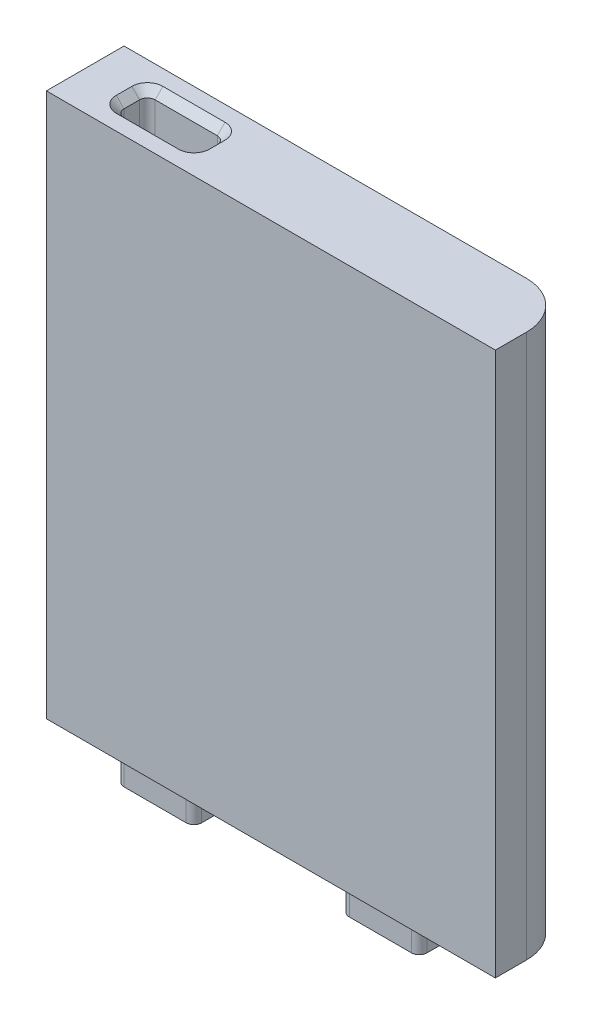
ISO-10303-21;
HEADER;
FILE_DESCRIPTION(('STEP AP214'),'2;1');
FILE_NAME('part.step','',(''),(''),'','','');
FILE_SCHEMA(('AUTOMOTIVE_DESIGN { 1 0 10303 214 1 1 1 1 }'));
ENDSEC;
DATA;
#1=APPLICATION_CONTEXT('core data for automotive mechanical design processes');
#2=APPLICATION_PROTOCOL_DEFINITION('international standard','automotive_design',2000,#1);
#3=PRODUCT_CONTEXT('',#1,'mechanical');
#4=PRODUCT('Part','Part','',(#3));
#5=PRODUCT_RELATED_PRODUCT_CATEGORY('part','',(#4));
#6=PRODUCT_DEFINITION_FORMATION('','',#4);
#7=PRODUCT_DEFINITION_CONTEXT('part definition',#1,'design');
#8=PRODUCT_DEFINITION('design','',#6,#7);
#9=PRODUCT_DEFINITION_SHAPE('','',#8);
#10=(LENGTH_UNIT() NAMED_UNIT(*) SI_UNIT(.MILLI.,.METRE.));
#11=(NAMED_UNIT(*) PLANE_ANGLE_UNIT() SI_UNIT($,.RADIAN.));
#12=(NAMED_UNIT(*) SI_UNIT($,.STERADIAN.) SOLID_ANGLE_UNIT());
#13=UNCERTAINTY_MEASURE_WITH_UNIT(LENGTH_MEASURE(1.E-05),#10,'distance_accuracy_value','');
#14=(GEOMETRIC_REPRESENTATION_CONTEXT(3) GLOBAL_UNCERTAINTY_ASSIGNED_CONTEXT((#13)) GLOBAL_UNIT_ASSIGNED_CONTEXT((#10,
#11,#12)) REPRESENTATION_CONTEXT('',''));
#15=CARTESIAN_POINT('',(0.,0.,0.));
#16=DIRECTION('',(0.,0.,1.));
#17=DIRECTION('',(1.,0.,0.));
#18=AXIS2_PLACEMENT_3D('',#15,#16,#17);
#19=CARTESIAN_POINT('',(0.,0.,5.));
#20=DIRECTION('',(0.,1.,0.));
#21=DIRECTION('',(0.,0.,1.));
#22=AXIS2_PLACEMENT_3D('',#19,#20,#21);
#23=PLANE('',#22);
#24=CARTESIAN_POINT('',(7.5,0.,3.));
#25=DIRECTION('',(0.,-1.,0.));
#26=DIRECTION('',(0.,0.,1.));
#27=AXIS2_PLACEMENT_3D('',#24,#25,#26);
#28=CIRCLE('',#27,0.5);
#29=CARTESIAN_POINT('',(8.,0.,3.));
#30=VERTEX_POINT('',#29);
#31=CARTESIAN_POINT('',(7.5,0.,3.5));
#32=VERTEX_POINT('',#31);
#33=EDGE_CURVE('E308',#30,#32,#28,.T.);
#34=ORIENTED_EDGE('',*,*,#33,.F.);
#35=DIRECTION('',(0.,0.,1.));
#36=VECTOR('',#35,1.);
#37=CARTESIAN_POINT('',(8.,0.,3.));
#38=LINE('',#37,#36);
#39=CARTESIAN_POINT('',(8.,0.,2.));
#40=VERTEX_POINT('',#39);
#41=EDGE_CURVE('E330',#40,#30,#38,.T.);
#42=ORIENTED_EDGE('',*,*,#41,.F.);
#43=CARTESIAN_POINT('',(7.5,0.,2.));
#44=DIRECTION('',(0.,-1.,0.));
#45=DIRECTION('',(0.,0.,-1.));
#46=AXIS2_PLACEMENT_3D('',#43,#44,#45);
#47=CIRCLE('',#46,0.5);
#48=CARTESIAN_POINT('',(7.5,0.,1.5));
#49=VERTEX_POINT('',#48);
#50=EDGE_CURVE('E362',#49,#40,#47,.T.);
#51=ORIENTED_EDGE('',*,*,#50,.F.);
#52=DIRECTION('',(1.,0.,0.));
#53=VECTOR('',#52,1.);
#54=CARTESIAN_POINT('',(3.5,0.,1.5));
#55=LINE('',#54,#53);
#56=CARTESIAN_POINT('',(3.5,0.,1.5));
#57=VERTEX_POINT('',#56);
#58=EDGE_CURVE('E359',#57,#49,#55,.T.);
#59=ORIENTED_EDGE('',*,*,#58,.F.);
#60=CARTESIAN_POINT('',(3.5,0.,2.));
#61=DIRECTION('',(0.,-1.,0.));
#62=DIRECTION('',(0.,0.,-1.));
#63=AXIS2_PLACEMENT_3D('',#60,#61,#62);
#64=CIRCLE('',#63,0.5);
#65=CARTESIAN_POINT('',(3.,0.,2.));
#66=VERTEX_POINT('',#65);
#67=EDGE_CURVE('E356',#66,#57,#64,.T.);
#68=ORIENTED_EDGE('',*,*,#67,.F.);
#69=DIRECTION('',(0.,0.,-1.));
#70=VECTOR('',#69,1.);
#71=CARTESIAN_POINT('',(3.,0.,3.));
#72=LINE('',#71,#70);
#73=CARTESIAN_POINT('',(3.,0.,3.));
#74=VERTEX_POINT('',#73);
#75=EDGE_CURVE('E353',#74,#66,#72,.T.);
#76=ORIENTED_EDGE('',*,*,#75,.F.);
#77=CARTESIAN_POINT('',(3.5,0.,3.));
#78=DIRECTION('',(0.,-1.,0.));
#79=DIRECTION('',(0.,0.,-1.));
#80=AXIS2_PLACEMENT_3D('',#77,#78,#79);
#81=CIRCLE('',#80,0.5);
#82=CARTESIAN_POINT('',(3.5,0.,3.5));
#83=VERTEX_POINT('',#82);
#84=EDGE_CURVE('E350',#83,#74,#81,.T.);
#85=ORIENTED_EDGE('',*,*,#84,.F.);
#86=DIRECTION('',(-1.,0.,0.));
#87=VECTOR('',#86,1.);
#88=CARTESIAN_POINT('',(3.5,0.,3.5));
#89=LINE('',#88,#87);
#90=EDGE_CURVE('E347',#32,#83,#89,.T.);
#91=ORIENTED_EDGE('',*,*,#90,.F.);
#92=EDGE_LOOP('',(#34,#42,#51,#59,#68,#76,#85,#91));
#93=FACE_BOUND('',#92,.T.);
#94=DIRECTION('',(1.,0.,0.));
#95=VECTOR('',#94,1.);
#96=CARTESIAN_POINT('',(0.,0.,0.));
#97=LINE('',#96,#95);
#98=CARTESIAN_POINT('',(0.,0.,0.));
#99=VERTEX_POINT('',#98);
#100=CARTESIAN_POINT('',(25.9,0.,0.));
#101=VERTEX_POINT('',#100);
#102=EDGE_CURVE('E404',#99,#101,#97,.T.);
#103=ORIENTED_EDGE('',*,*,#102,.T.);
#104=CARTESIAN_POINT('',(25.9,0.,3.));
#105=DIRECTION('',(0.,1.,0.));
#106=DIRECTION('',(0.,0.,1.));
#107=AXIS2_PLACEMENT_3D('',#104,#105,#106);
#108=CIRCLE('',#107,3.);
#109=CARTESIAN_POINT('',(28.9,0.,3.));
#110=VERTEX_POINT('',#109);
#111=EDGE_CURVE('E426',#101,#110,#108,.F.);
#112=ORIENTED_EDGE('',*,*,#111,.T.);
#113=DIRECTION('',(0.,0.,-1.));
#114=VECTOR('',#113,1.);
#115=CARTESIAN_POINT('',(28.9,0.,5.));
#116=LINE('',#115,#114);
#117=CARTESIAN_POINT('',(28.9,0.,5.));
#118=VERTEX_POINT('',#117);
#119=EDGE_CURVE('E413',#118,#110,#116,.T.);
#120=ORIENTED_EDGE('',*,*,#119,.F.);
#121=DIRECTION('',(1.,0.,0.));
#122=VECTOR('',#121,1.);
#123=CARTESIAN_POINT('',(0.,0.,5.));
#124=LINE('',#123,#122);
#125=CARTESIAN_POINT('',(0.,0.,5.));
#126=VERTEX_POINT('',#125);
#127=EDGE_CURVE('E394',#126,#118,#124,.T.);
#128=ORIENTED_EDGE('',*,*,#127,.F.);
#129=DIRECTION('',(0.,0.,-1.));
#130=VECTOR('',#129,1.);
#131=CARTESIAN_POINT('',(0.,0.,5.));
#132=LINE('',#131,#130);
#133=EDGE_CURVE('E416',#126,#99,#132,.T.);
#134=ORIENTED_EDGE('',*,*,#133,.T.);
#135=EDGE_LOOP('',(#103,#112,#120,#128,#134));
#136=FACE_BOUND('',#135,.T.);
#137=CARTESIAN_POINT('',(22.,0.,3.));
#138=DIRECTION('',(0.,-1.,0.));
#139=DIRECTION('',(0.,0.,1.));
#140=AXIS2_PLACEMENT_3D('',#137,#138,#139);
#141=CIRCLE('',#140,0.5);
#142=CARTESIAN_POINT('',(22.5,0.,3.));
#143=VERTEX_POINT('',#142);
#144=CARTESIAN_POINT('',(22.,0.,3.5));
#145=VERTEX_POINT('',#144);
#146=EDGE_CURVE('E274',#143,#145,#141,.T.);
#147=ORIENTED_EDGE('',*,*,#146,.F.);
#148=DIRECTION('',(0.,0.,1.));
#149=VECTOR('',#148,1.);
#150=CARTESIAN_POINT('',(22.5,0.,3.));
#151=LINE('',#150,#149);
#152=CARTESIAN_POINT('',(22.5,0.,2.));
#153=VERTEX_POINT('',#152);
#154=EDGE_CURVE('E271',#153,#143,#151,.T.);
#155=ORIENTED_EDGE('',*,*,#154,.F.);
#156=CARTESIAN_POINT('',(22.,0.,2.));
#157=DIRECTION('',(0.,-1.,0.));
#158=DIRECTION('',(0.,0.,-1.));
#159=AXIS2_PLACEMENT_3D('',#156,#157,#158);
#160=CIRCLE('',#159,0.5);
#161=CARTESIAN_POINT('',(22.,0.,1.5));
#162=VERTEX_POINT('',#161);
#163=EDGE_CURVE('E503',#162,#153,#160,.T.);
#164=ORIENTED_EDGE('',*,*,#163,.F.);
#165=DIRECTION('',(1.,0.,0.));
#166=VECTOR('',#165,1.);
#167=CARTESIAN_POINT('',(18.,0.,1.5));
#168=LINE('',#167,#166);
#169=CARTESIAN_POINT('',(18.,0.,1.5));
#170=VERTEX_POINT('',#169);
#171=EDGE_CURVE('E500',#170,#162,#168,.T.);
#172=ORIENTED_EDGE('',*,*,#171,.F.);
#173=CARTESIAN_POINT('',(18.,0.,2.));
#174=DIRECTION('',(0.,-1.,0.));
#175=DIRECTION('',(0.,0.,-1.));
#176=AXIS2_PLACEMENT_3D('',#173,#174,#175);
#177=CIRCLE('',#176,0.5);
#178=CARTESIAN_POINT('',(17.5,0.,2.));
#179=VERTEX_POINT('',#178);
#180=EDGE_CURVE('E497',#179,#170,#177,.T.);
#181=ORIENTED_EDGE('',*,*,#180,.F.);
#182=DIRECTION('',(0.,0.,-1.));
#183=VECTOR('',#182,1.);
#184=CARTESIAN_POINT('',(17.5,0.,3.));
#185=LINE('',#184,#183);
#186=CARTESIAN_POINT('',(17.5,0.,3.));
#187=VERTEX_POINT('',#186);
#188=EDGE_CURVE('E494',#187,#179,#185,.T.);
#189=ORIENTED_EDGE('',*,*,#188,.F.);
#190=CARTESIAN_POINT('',(18.,0.,3.));
#191=DIRECTION('',(0.,-1.,0.));
#192=DIRECTION('',(0.,0.,-1.));
#193=AXIS2_PLACEMENT_3D('',#190,#191,#192);
#194=CIRCLE('',#193,0.5);
#195=CARTESIAN_POINT('',(18.,0.,3.5));
#196=VERTEX_POINT('',#195);
#197=EDGE_CURVE('E487',#196,#187,#194,.T.);
#198=ORIENTED_EDGE('',*,*,#197,.F.);
#199=DIRECTION('',(-1.,0.,0.));
#200=VECTOR('',#199,1.);
#201=CARTESIAN_POINT('',(18.,0.,3.5));
#202=LINE('',#201,#200);
#203=EDGE_CURVE('E485',#145,#196,#202,.T.);
#204=ORIENTED_EDGE('',*,*,#203,.F.);
#205=EDGE_LOOP('',(#147,#155,#164,#172,#181,#189,#198,#204));
#206=FACE_BOUND('',#205,.T.);
#207=ADVANCED_FACE('F35',(#93,#136,#206),#23,.F.);
#208=CARTESIAN_POINT('',(0.,0.,5.));
#209=DIRECTION('',(1.,0.,0.));
#210=DIRECTION('',(0.,0.,-1.));
#211=AXIS2_PLACEMENT_3D('',#208,#209,#210);
#212=PLANE('',#211);
#213=DIRECTION('',(0.,-1.,0.));
#214=VECTOR('',#213,1.);
#215=CARTESIAN_POINT('',(0.,0.,0.));
#216=LINE('',#215,#214);
#217=CARTESIAN_POINT('',(0.,35.,0.));
#218=VERTEX_POINT('',#217);
#219=EDGE_CURVE('E390',#218,#99,#216,.T.);
#220=ORIENTED_EDGE('',*,*,#219,.T.);
#221=ORIENTED_EDGE('',*,*,#133,.F.);
#222=DIRECTION('',(0.,-1.,0.));
#223=VECTOR('',#222,1.);
#224=CARTESIAN_POINT('',(0.,0.,5.));
#225=LINE('',#224,#223);
#226=CARTESIAN_POINT('',(0.,35.,5.));
#227=VERTEX_POINT('',#226);
#228=EDGE_CURVE('E391',#227,#126,#225,.T.);
#229=ORIENTED_EDGE('',*,*,#228,.F.);
#230=DIRECTION('',(0.,0.,-1.));
#231=VECTOR('',#230,1.);
#232=CARTESIAN_POINT('',(0.,35.,5.));
#233=LINE('',#232,#231);
#234=EDGE_CURVE('E401',#227,#218,#233,.T.);
#235=ORIENTED_EDGE('',*,*,#234,.T.);
#236=EDGE_LOOP('',(#220,#221,#229,#235));
#237=FACE_BOUND('',#236,.T.);
#238=ADVANCED_FACE('F561',(#237),#212,.F.);
#239=CARTESIAN_POINT('',(28.9,0.,5.));
#240=DIRECTION('',(-1.,0.,0.));
#241=DIRECTION('',(0.,0.,1.));
#242=AXIS2_PLACEMENT_3D('',#239,#240,#241);
#243=PLANE('',#242);
#244=ORIENTED_EDGE('',*,*,#119,.T.);
#245=DIRECTION('',(0.,1.,0.));
#246=VECTOR('',#245,1.);
#247=CARTESIAN_POINT('',(28.9,35.,3.));
#248=LINE('',#247,#246);
#249=CARTESIAN_POINT('',(28.9,35.,3.));
#250=VERTEX_POINT('',#249);
#251=EDGE_CURVE('E419',#110,#250,#248,.T.);
#252=ORIENTED_EDGE('',*,*,#251,.T.);
#253=DIRECTION('',(0.,0.,-1.));
#254=VECTOR('',#253,1.);
#255=CARTESIAN_POINT('',(28.9,35.,5.));
#256=LINE('',#255,#254);
#257=CARTESIAN_POINT('',(28.9,35.,5.));
#258=VERTEX_POINT('',#257);
#259=EDGE_CURVE('E410',#258,#250,#256,.T.);
#260=ORIENTED_EDGE('',*,*,#259,.F.);
#261=DIRECTION('',(0.,1.,0.));
#262=VECTOR('',#261,1.);
#263=CARTESIAN_POINT('',(28.9,0.,5.));
#264=LINE('',#263,#262);
#265=EDGE_CURVE('E397',#118,#258,#264,.T.);
#266=ORIENTED_EDGE('',*,*,#265,.F.);
#267=EDGE_LOOP('',(#244,#252,#260,#266));
#268=FACE_BOUND('',#267,.T.);
#269=ADVANCED_FACE('F567',(#268),#243,.F.);
#270=CARTESIAN_POINT('',(0.,35.,5.));
#271=DIRECTION('',(0.,-1.,0.));
#272=DIRECTION('',(0.,0.,-1.));
#273=AXIS2_PLACEMENT_3D('',#270,#271,#272);
#274=PLANE('',#273);
#275=DIRECTION('',(1.,0.,0.));
#276=VECTOR('',#275,1.);
#277=CARTESIAN_POINT('',(0.,35.,1.00000000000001));
#278=LINE('',#277,#276);
#279=CARTESIAN_POINT('',(3.50000000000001,35.,1.00000000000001));
#280=VERTEX_POINT('',#279);
#281=CARTESIAN_POINT('',(7.49999999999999,35.,1.00000000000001));
#282=VERTEX_POINT('',#281);
#283=EDGE_CURVE('E431',#280,#282,#278,.T.);
#284=ORIENTED_EDGE('',*,*,#283,.T.);
#285=CARTESIAN_POINT('',(7.5,35.,2.));
#286=DIRECTION('',(0.,-1.,0.));
#287=DIRECTION('',(0.,0.,-1.));
#288=AXIS2_PLACEMENT_3D('',#285,#286,#287);
#289=CIRCLE('',#288,0.999999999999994);
#290=CARTESIAN_POINT('',(8.49999999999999,35.,2.00000000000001));
#291=VERTEX_POINT('',#290);
#292=EDGE_CURVE('E445',#282,#291,#289,.T.);
#293=ORIENTED_EDGE('',*,*,#292,.T.);
#294=DIRECTION('',(0.,0.,1.));
#295=VECTOR('',#294,1.);
#296=CARTESIAN_POINT('',(8.49999999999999,35.,5.));
#297=LINE('',#296,#295);
#298=CARTESIAN_POINT('',(8.49999999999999,35.,3.));
#299=VERTEX_POINT('',#298);
#300=EDGE_CURVE('E443',#291,#299,#297,.T.);
#301=ORIENTED_EDGE('',*,*,#300,.T.);
#302=CARTESIAN_POINT('',(7.5,35.,3.));
#303=DIRECTION('',(0.,-1.,0.));
#304=DIRECTION('',(0.,0.,-1.));
#305=AXIS2_PLACEMENT_3D('',#302,#303,#304);
#306=CIRCLE('',#305,0.999999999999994);
#307=CARTESIAN_POINT('',(7.49999999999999,35.,3.99999999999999));
#308=VERTEX_POINT('',#307);
#309=EDGE_CURVE('E441',#299,#308,#306,.T.);
#310=ORIENTED_EDGE('',*,*,#309,.T.);
#311=DIRECTION('',(-1.,0.,0.));
#312=VECTOR('',#311,1.);
#313=CARTESIAN_POINT('',(0.,35.,3.99999999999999));
#314=LINE('',#313,#312);
#315=CARTESIAN_POINT('',(3.5,35.,3.99999999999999));
#316=VERTEX_POINT('',#315);
#317=EDGE_CURVE('E439',#308,#316,#314,.T.);
#318=ORIENTED_EDGE('',*,*,#317,.T.);
#319=CARTESIAN_POINT('',(3.5,35.,3.));
#320=DIRECTION('',(0.,-1.,0.));
#321=DIRECTION('',(0.,0.,-1.));
#322=AXIS2_PLACEMENT_3D('',#319,#320,#321);
#323=CIRCLE('',#322,0.999999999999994);
#324=CARTESIAN_POINT('',(2.50000000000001,35.,2.99999999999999));
#325=VERTEX_POINT('',#324);
#326=EDGE_CURVE('E437',#316,#325,#323,.T.);
#327=ORIENTED_EDGE('',*,*,#326,.T.);
#328=DIRECTION('',(0.,0.,-1.));
#329=VECTOR('',#328,1.);
#330=CARTESIAN_POINT('',(2.50000000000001,35.,5.));
#331=LINE('',#330,#329);
#332=CARTESIAN_POINT('',(2.50000000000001,35.,2.));
#333=VERTEX_POINT('',#332);
#334=EDGE_CURVE('E435',#325,#333,#331,.T.);
#335=ORIENTED_EDGE('',*,*,#334,.T.);
#336=CARTESIAN_POINT('',(3.5,35.,2.));
#337=DIRECTION('',(0.,-1.,0.));
#338=DIRECTION('',(0.,0.,-1.));
#339=AXIS2_PLACEMENT_3D('',#336,#337,#338);
#340=CIRCLE('',#339,0.999999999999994);
#341=EDGE_CURVE('E433',#333,#280,#340,.T.);
#342=ORIENTED_EDGE('',*,*,#341,.T.);
#343=EDGE_LOOP('',(#284,#293,#301,#310,#318,#327,#335,#342));
#344=FACE_BOUND('',#343,.T.);
#345=ORIENTED_EDGE('',*,*,#259,.T.);
#346=CARTESIAN_POINT('',(25.9,35.,3.));
#347=DIRECTION('',(0.,-1.,0.));
#348=DIRECTION('',(0.,0.,-1.));
#349=AXIS2_PLACEMENT_3D('',#346,#347,#348);
#350=CIRCLE('',#349,3.);
#351=CARTESIAN_POINT('',(25.9,35.,0.));
#352=VERTEX_POINT('',#351);
#353=EDGE_CURVE('E422',#250,#352,#350,.F.);
#354=ORIENTED_EDGE('',*,*,#353,.T.);
#355=DIRECTION('',(-1.,0.,0.));
#356=VECTOR('',#355,1.);
#357=CARTESIAN_POINT('',(0.,35.,0.));
#358=LINE('',#357,#356);
#359=EDGE_CURVE('E395',#352,#218,#358,.T.);
#360=ORIENTED_EDGE('',*,*,#359,.T.);
#361=ORIENTED_EDGE('',*,*,#234,.F.);
#362=DIRECTION('',(-1.,0.,0.));
#363=VECTOR('',#362,1.);
#364=CARTESIAN_POINT('',(0.,35.,5.));
#365=LINE('',#364,#363);
#366=EDGE_CURVE('E399',#258,#227,#365,.T.);
#367=ORIENTED_EDGE('',*,*,#366,.F.);
#368=EDGE_LOOP('',(#345,#354,#360,#361,#367));
#369=FACE_BOUND('',#368,.T.);
#370=ADVANCED_FACE('F615',(#344,#369),#274,.F.);
#371=CARTESIAN_POINT('',(0.,0.,5.));
#372=DIRECTION('',(0.,0.,-1.));
#373=DIRECTION('',(-1.,0.,0.));
#374=AXIS2_PLACEMENT_3D('',#371,#372,#373);
#375=PLANE('',#374);
#376=ORIENTED_EDGE('',*,*,#228,.T.);
#377=ORIENTED_EDGE('',*,*,#127,.T.);
#378=ORIENTED_EDGE('',*,*,#265,.T.);
#379=ORIENTED_EDGE('',*,*,#366,.T.);
#380=EDGE_LOOP('',(#376,#377,#378,#379));
#381=FACE_BOUND('',#380,.T.);
#382=ADVANCED_FACE('F700',(#381),#375,.F.);
#383=CARTESIAN_POINT('',(0.,0.,0.));
#384=DIRECTION('',(0.,0.,-1.));
#385=DIRECTION('',(-1.,0.,0.));
#386=AXIS2_PLACEMENT_3D('',#383,#384,#385);
#387=PLANE('',#386);
#388=ORIENTED_EDGE('',*,*,#359,.F.);
#389=DIRECTION('',(0.,1.,0.));
#390=VECTOR('',#389,1.);
#391=CARTESIAN_POINT('',(25.9,0.,0.));
#392=LINE('',#391,#390);
#393=EDGE_CURVE('E424',#352,#101,#392,.F.);
#394=ORIENTED_EDGE('',*,*,#393,.T.);
#395=ORIENTED_EDGE('',*,*,#102,.F.);
#396=ORIENTED_EDGE('',*,*,#219,.F.);
#397=EDGE_LOOP('',(#388,#394,#395,#396));
#398=FACE_BOUND('',#397,.T.);
#399=ADVANCED_FACE('F578',(#398),#387,.T.);
#400=CARTESIAN_POINT('',(25.9,0.,3.));
#401=DIRECTION('',(0.,-1.,0.));
#402=DIRECTION('',(0.,0.,-1.));
#403=AXIS2_PLACEMENT_3D('',#400,#401,#402);
#404=CYLINDRICAL_SURFACE('',#403,3.);
#405=ORIENTED_EDGE('',*,*,#111,.F.);
#406=ORIENTED_EDGE('',*,*,#393,.F.);
#407=ORIENTED_EDGE('',*,*,#353,.F.);
#408=ORIENTED_EDGE('',*,*,#251,.F.);
#409=EDGE_LOOP('',(#405,#406,#407,#408));
#410=FACE_BOUND('',#409,.T.);
#411=ADVANCED_FACE('F574',(#410),#404,.T.);
#412=CARTESIAN_POINT('',(7.5,-2.8,3.));
#413=DIRECTION('',(0.,1.,0.));
#414=DIRECTION('',(0.,0.,1.));
#415=AXIS2_PLACEMENT_3D('',#412,#413,#414);
#416=CYLINDRICAL_SURFACE('',#415,0.5);
#417=ORIENTED_EDGE('',*,*,#33,.T.);
#418=DIRECTION('',(0.,1.,0.));
#419=VECTOR('',#418,1.);
#420=CARTESIAN_POINT('',(7.5,-2.8,3.5));
#421=LINE('',#420,#419);
#422=CARTESIAN_POINT('',(7.5,-2.8,3.5));
#423=VERTEX_POINT('',#422);
#424=EDGE_CURVE('E387',#423,#32,#421,.T.);
#425=ORIENTED_EDGE('',*,*,#424,.F.);
#426=CARTESIAN_POINT('',(7.5,-2.8,3.));
#427=DIRECTION('',(0.,-1.,0.));
#428=DIRECTION('',(0.,0.,1.));
#429=AXIS2_PLACEMENT_3D('',#426,#427,#428);
#430=CIRCLE('',#429,0.5);
#431=CARTESIAN_POINT('',(8.,-2.8,3.));
#432=VERTEX_POINT('',#431);
#433=EDGE_CURVE('E326',#432,#423,#430,.T.);
#434=ORIENTED_EDGE('',*,*,#433,.F.);
#435=DIRECTION('',(0.,1.,0.));
#436=VECTOR('',#435,1.);
#437=CARTESIAN_POINT('',(8.,-2.8,3.));
#438=LINE('',#437,#436);
#439=EDGE_CURVE('E344',#432,#30,#438,.T.);
#440=ORIENTED_EDGE('',*,*,#439,.T.);
#441=EDGE_LOOP('',(#417,#425,#434,#440));
#442=FACE_BOUND('',#441,.T.);
#443=ADVANCED_FACE('F577',(#442),#416,.T.);
#444=CARTESIAN_POINT('',(3.5,-2.8,3.5));
#445=DIRECTION('',(0.,0.,-1.));
#446=DIRECTION('',(-1.,0.,0.));
#447=AXIS2_PLACEMENT_3D('',#444,#445,#446);
#448=PLANE('',#447);
#449=ORIENTED_EDGE('',*,*,#90,.T.);
#450=DIRECTION('',(0.,1.,0.));
#451=VECTOR('',#450,1.);
#452=CARTESIAN_POINT('',(3.5,-2.8,3.5));
#453=LINE('',#452,#451);
#454=CARTESIAN_POINT('',(3.5,-2.8,3.5));
#455=VERTEX_POINT('',#454);
#456=EDGE_CURVE('E384',#455,#83,#453,.T.);
#457=ORIENTED_EDGE('',*,*,#456,.F.);
#458=DIRECTION('',(-1.,0.,0.));
#459=VECTOR('',#458,1.);
#460=CARTESIAN_POINT('',(3.5,-2.8,3.5));
#461=LINE('',#460,#459);
#462=EDGE_CURVE('E329',#423,#455,#461,.T.);
#463=ORIENTED_EDGE('',*,*,#462,.F.);
#464=ORIENTED_EDGE('',*,*,#424,.T.);
#465=EDGE_LOOP('',(#449,#457,#463,#464));
#466=FACE_BOUND('',#465,.T.);
#467=ADVANCED_FACE('F692',(#466),#448,.F.);
#468=CARTESIAN_POINT('',(3.5,-2.8,3.));
#469=DIRECTION('',(0.,1.,0.));
#470=DIRECTION('',(0.,0.,1.));
#471=AXIS2_PLACEMENT_3D('',#468,#469,#470);
#472=CYLINDRICAL_SURFACE('',#471,0.5);
#473=ORIENTED_EDGE('',*,*,#84,.T.);
#474=DIRECTION('',(0.,1.,0.));
#475=VECTOR('',#474,1.);
#476=CARTESIAN_POINT('',(3.,-2.8,3.));
#477=LINE('',#476,#475);
#478=CARTESIAN_POINT('',(3.,-2.8,3.));
#479=VERTEX_POINT('',#478);
#480=EDGE_CURVE('E381',#479,#74,#477,.T.);
#481=ORIENTED_EDGE('',*,*,#480,.F.);
#482=CARTESIAN_POINT('',(3.5,-2.8,3.));
#483=DIRECTION('',(0.,-1.,0.));
#484=DIRECTION('',(0.,0.,-1.));
#485=AXIS2_PLACEMENT_3D('',#482,#483,#484);
#486=CIRCLE('',#485,0.5);
#487=EDGE_CURVE('E332',#455,#479,#486,.T.);
#488=ORIENTED_EDGE('',*,*,#487,.F.);
#489=ORIENTED_EDGE('',*,*,#456,.T.);
#490=EDGE_LOOP('',(#473,#481,#488,#489));
#491=FACE_BOUND('',#490,.T.);
#492=ADVANCED_FACE('F688',(#491),#472,.T.);
#493=CARTESIAN_POINT('',(3.,-2.8,3.));
#494=DIRECTION('',(1.,0.,0.));
#495=DIRECTION('',(0.,0.,-1.));
#496=AXIS2_PLACEMENT_3D('',#493,#494,#495);
#497=PLANE('',#496);
#498=ORIENTED_EDGE('',*,*,#75,.T.);
#499=DIRECTION('',(0.,1.,0.));
#500=VECTOR('',#499,1.);
#501=CARTESIAN_POINT('',(3.,-2.8,2.));
#502=LINE('',#501,#500);
#503=CARTESIAN_POINT('',(3.,-2.8,2.));
#504=VERTEX_POINT('',#503);
#505=EDGE_CURVE('E378',#504,#66,#502,.T.);
#506=ORIENTED_EDGE('',*,*,#505,.F.);
#507=DIRECTION('',(0.,0.,-1.));
#508=VECTOR('',#507,1.);
#509=CARTESIAN_POINT('',(3.,-2.8,3.));
#510=LINE('',#509,#508);
#511=EDGE_CURVE('E334',#479,#504,#510,.T.);
#512=ORIENTED_EDGE('',*,*,#511,.F.);
#513=ORIENTED_EDGE('',*,*,#480,.T.);
#514=EDGE_LOOP('',(#498,#506,#512,#513));
#515=FACE_BOUND('',#514,.T.);
#516=ADVANCED_FACE('F684',(#515),#497,.F.);
#517=CARTESIAN_POINT('',(3.5,-2.8,2.));
#518=DIRECTION('',(0.,1.,0.));
#519=DIRECTION('',(0.,0.,1.));
#520=AXIS2_PLACEMENT_3D('',#517,#518,#519);
#521=CYLINDRICAL_SURFACE('',#520,0.5);
#522=ORIENTED_EDGE('',*,*,#67,.T.);
#523=DIRECTION('',(0.,1.,0.));
#524=VECTOR('',#523,1.);
#525=CARTESIAN_POINT('',(3.5,-2.8,1.5));
#526=LINE('',#525,#524);
#527=CARTESIAN_POINT('',(3.5,-2.8,1.5));
#528=VERTEX_POINT('',#527);
#529=EDGE_CURVE('E375',#528,#57,#526,.T.);
#530=ORIENTED_EDGE('',*,*,#529,.F.);
#531=CARTESIAN_POINT('',(3.5,-2.8,2.));
#532=DIRECTION('',(0.,-1.,0.));
#533=DIRECTION('',(0.,0.,-1.));
#534=AXIS2_PLACEMENT_3D('',#531,#532,#533);
#535=CIRCLE('',#534,0.5);
#536=EDGE_CURVE('E336',#504,#528,#535,.T.);
#537=ORIENTED_EDGE('',*,*,#536,.F.);
#538=ORIENTED_EDGE('',*,*,#505,.T.);
#539=EDGE_LOOP('',(#522,#530,#537,#538));
#540=FACE_BOUND('',#539,.T.);
#541=ADVANCED_FACE('F680',(#540),#521,.T.);
#542=CARTESIAN_POINT('',(3.5,-2.8,1.5));
#543=DIRECTION('',(0.,0.,1.));
#544=DIRECTION('',(1.,0.,0.));
#545=AXIS2_PLACEMENT_3D('',#542,#543,#544);
#546=PLANE('',#545);
#547=ORIENTED_EDGE('',*,*,#58,.T.);
#548=DIRECTION('',(0.,1.,0.));
#549=VECTOR('',#548,1.);
#550=CARTESIAN_POINT('',(7.5,-2.8,1.5));
#551=LINE('',#550,#549);
#552=CARTESIAN_POINT('',(7.5,-2.8,1.5));
#553=VERTEX_POINT('',#552);
#554=EDGE_CURVE('E372',#553,#49,#551,.T.);
#555=ORIENTED_EDGE('',*,*,#554,.F.);
#556=DIRECTION('',(1.,0.,0.));
#557=VECTOR('',#556,1.);
#558=CARTESIAN_POINT('',(3.5,-2.8,1.5));
#559=LINE('',#558,#557);
#560=EDGE_CURVE('E338',#528,#553,#559,.T.);
#561=ORIENTED_EDGE('',*,*,#560,.F.);
#562=ORIENTED_EDGE('',*,*,#529,.T.);
#563=EDGE_LOOP('',(#547,#555,#561,#562));
#564=FACE_BOUND('',#563,.T.);
#565=ADVANCED_FACE('F676',(#564),#546,.F.);
#566=CARTESIAN_POINT('',(7.5,-2.8,2.));
#567=DIRECTION('',(0.,1.,0.));
#568=DIRECTION('',(0.,0.,1.));
#569=AXIS2_PLACEMENT_3D('',#566,#567,#568);
#570=CYLINDRICAL_SURFACE('',#569,0.5);
#571=ORIENTED_EDGE('',*,*,#50,.T.);
#572=DIRECTION('',(0.,1.,0.));
#573=VECTOR('',#572,1.);
#574=CARTESIAN_POINT('',(8.,-2.8,2.));
#575=LINE('',#574,#573);
#576=CARTESIAN_POINT('',(8.,-2.8,2.));
#577=VERTEX_POINT('',#576);
#578=EDGE_CURVE('E369',#577,#40,#575,.T.);
#579=ORIENTED_EDGE('',*,*,#578,.F.);
#580=CARTESIAN_POINT('',(7.5,-2.8,2.));
#581=DIRECTION('',(0.,-1.,0.));
#582=DIRECTION('',(0.,0.,-1.));
#583=AXIS2_PLACEMENT_3D('',#580,#581,#582);
#584=CIRCLE('',#583,0.5);
#585=EDGE_CURVE('E340',#553,#577,#584,.T.);
#586=ORIENTED_EDGE('',*,*,#585,.F.);
#587=ORIENTED_EDGE('',*,*,#554,.T.);
#588=EDGE_LOOP('',(#571,#579,#586,#587));
#589=FACE_BOUND('',#588,.T.);
#590=ADVANCED_FACE('F672',(#589),#570,.T.);
#591=CARTESIAN_POINT('',(8.,-2.8,3.));
#592=DIRECTION('',(-1.,0.,0.));
#593=DIRECTION('',(0.,0.,1.));
#594=AXIS2_PLACEMENT_3D('',#591,#592,#593);
#595=PLANE('',#594);
#596=ORIENTED_EDGE('',*,*,#41,.T.);
#597=ORIENTED_EDGE('',*,*,#439,.F.);
#598=DIRECTION('',(0.,0.,1.));
#599=VECTOR('',#598,1.);
#600=CARTESIAN_POINT('',(8.,-2.8,3.));
#601=LINE('',#600,#599);
#602=EDGE_CURVE('E342',#577,#432,#601,.T.);
#603=ORIENTED_EDGE('',*,*,#602,.F.);
#604=ORIENTED_EDGE('',*,*,#578,.T.);
#605=EDGE_LOOP('',(#596,#597,#603,#604));
#606=FACE_BOUND('',#605,.T.);
#607=ADVANCED_FACE('F668',(#606),#595,.F.);
#608=CARTESIAN_POINT('',(7.5,-2.8,3.));
#609=DIRECTION('',(0.,1.,0.));
#610=DIRECTION('',(0.,0.,1.));
#611=AXIS2_PLACEMENT_3D('',#608,#609,#610);
#612=PLANE('',#611);
#613=ORIENTED_EDGE('',*,*,#433,.T.);
#614=ORIENTED_EDGE('',*,*,#462,.T.);
#615=ORIENTED_EDGE('',*,*,#487,.T.);
#616=ORIENTED_EDGE('',*,*,#511,.T.);
#617=ORIENTED_EDGE('',*,*,#536,.T.);
#618=ORIENTED_EDGE('',*,*,#560,.T.);
#619=ORIENTED_EDGE('',*,*,#585,.T.);
#620=ORIENTED_EDGE('',*,*,#602,.T.);
#621=EDGE_LOOP('',(#613,#614,#615,#616,#617,#618,#619,#620));
#622=FACE_BOUND('',#621,.T.);
#623=ADVANCED_FACE('F665',(#622),#612,.F.);
#624=CARTESIAN_POINT('',(7.5,32.,2.));
#625=DIRECTION('',(0.,1.,0.));
#626=DIRECTION('',(0.,0.,1.));
#627=AXIS2_PLACEMENT_3D('',#624,#625,#626);
#628=CYLINDRICAL_SURFACE('',#627,0.5);
#629=DIRECTION('',(0.,1.,0.));
#630=VECTOR('',#629,1.);
#631=CARTESIAN_POINT('',(8.,32.,2.));
#632=LINE('',#631,#630);
#633=CARTESIAN_POINT('',(8.,32.,2.));
#634=VERTEX_POINT('',#633);
#635=CARTESIAN_POINT('',(8.,34.5,2.));
#636=VERTEX_POINT('',#635);
#637=EDGE_CURVE('E305',#634,#636,#632,.T.);
#638=ORIENTED_EDGE('',*,*,#637,.T.);
#639=CARTESIAN_POINT('',(7.5,34.5,2.));
#640=DIRECTION('',(0.,-1.,0.));
#641=DIRECTION('',(0.,0.,-1.));
#642=AXIS2_PLACEMENT_3D('',#639,#640,#641);
#643=CIRCLE('',#642,0.5);
#644=CARTESIAN_POINT('',(7.5,34.5,1.5));
#645=VERTEX_POINT('',#644);
#646=EDGE_CURVE('E428',#636,#645,#643,.F.);
#647=ORIENTED_EDGE('',*,*,#646,.T.);
#648=DIRECTION('',(0.,1.,0.));
#649=VECTOR('',#648,1.);
#650=CARTESIAN_POINT('',(7.5,32.,1.5));
#651=LINE('',#650,#649);
#652=CARTESIAN_POINT('',(7.5,32.,1.5));
#653=VERTEX_POINT('',#652);
#654=EDGE_CURVE('E304',#653,#645,#651,.T.);
#655=ORIENTED_EDGE('',*,*,#654,.F.);
#656=CARTESIAN_POINT('',(7.5,32.,2.));
#657=DIRECTION('',(0.,1.,0.));
#658=DIRECTION('',(0.,0.,-1.));
#659=AXIS2_PLACEMENT_3D('',#656,#657,#658);
#660=CIRCLE('',#659,0.5);
#661=EDGE_CURVE('E275',#634,#653,#660,.T.);
#662=ORIENTED_EDGE('',*,*,#661,.F.);
#663=EDGE_LOOP('',(#638,#647,#655,#662));
#664=FACE_BOUND('',#663,.T.);
#665=ADVANCED_FACE('F648',(#664),#628,.F.);
#666=CARTESIAN_POINT('',(8.,32.,2.));
#667=DIRECTION('',(1.,0.,0.));
#668=DIRECTION('',(0.,0.,-1.));
#669=AXIS2_PLACEMENT_3D('',#666,#667,#668);
#670=PLANE('',#669);
#671=DIRECTION('',(0.,1.,0.));
#672=VECTOR('',#671,1.);
#673=CARTESIAN_POINT('',(8.,32.,3.));
#674=LINE('',#673,#672);
#675=CARTESIAN_POINT('',(8.,32.,3.));
#676=VERTEX_POINT('',#675);
#677=CARTESIAN_POINT('',(8.,34.5,3.));
#678=VERTEX_POINT('',#677);
#679=EDGE_CURVE('E309',#676,#678,#674,.T.);
#680=ORIENTED_EDGE('',*,*,#679,.T.);
#681=DIRECTION('',(0.,0.,-1.));
#682=VECTOR('',#681,1.);
#683=CARTESIAN_POINT('',(8.,34.5,2.));
#684=LINE('',#683,#682);
#685=EDGE_CURVE('E448',#678,#636,#684,.T.);
#686=ORIENTED_EDGE('',*,*,#685,.T.);
#687=ORIENTED_EDGE('',*,*,#637,.F.);
#688=DIRECTION('',(0.,0.,-1.));
#689=VECTOR('',#688,1.);
#690=CARTESIAN_POINT('',(8.,32.,2.));
#691=LINE('',#690,#689);
#692=EDGE_CURVE('E301',#676,#634,#691,.T.);
#693=ORIENTED_EDGE('',*,*,#692,.F.);
#694=EDGE_LOOP('',(#680,#686,#687,#693));
#695=FACE_BOUND('',#694,.T.);
#696=ADVANCED_FACE('F628',(#695),#670,.F.);
#697=CARTESIAN_POINT('',(7.5,32.,3.));
#698=DIRECTION('',(0.,1.,0.));
#699=DIRECTION('',(0.,0.,1.));
#700=AXIS2_PLACEMENT_3D('',#697,#698,#699);
#701=CYLINDRICAL_SURFACE('',#700,0.5);
#702=DIRECTION('',(0.,1.,0.));
#703=VECTOR('',#702,1.);
#704=CARTESIAN_POINT('',(7.5,32.,3.5));
#705=LINE('',#704,#703);
#706=CARTESIAN_POINT('',(7.5,32.,3.5));
#707=VERTEX_POINT('',#706);
#708=CARTESIAN_POINT('',(7.5,34.5,3.5));
#709=VERTEX_POINT('',#708);
#710=EDGE_CURVE('E312',#707,#709,#705,.T.);
#711=ORIENTED_EDGE('',*,*,#710,.T.);
#712=CARTESIAN_POINT('',(7.5,34.5,3.));
#713=DIRECTION('',(0.,-1.,0.));
#714=DIRECTION('',(0.,0.,-1.));
#715=AXIS2_PLACEMENT_3D('',#712,#713,#714);
#716=CIRCLE('',#715,0.5);
#717=EDGE_CURVE('E450',#709,#678,#716,.F.);
#718=ORIENTED_EDGE('',*,*,#717,.T.);
#719=ORIENTED_EDGE('',*,*,#679,.F.);
#720=CARTESIAN_POINT('',(7.5,32.,3.));
#721=DIRECTION('',(0.,1.,0.));
#722=DIRECTION('',(0.,0.,1.));
#723=AXIS2_PLACEMENT_3D('',#720,#721,#722);
#724=CIRCLE('',#723,0.5);
#725=EDGE_CURVE('E298',#707,#676,#724,.T.);
#726=ORIENTED_EDGE('',*,*,#725,.F.);
#727=EDGE_LOOP('',(#711,#718,#719,#726));
#728=FACE_BOUND('',#727,.T.);
#729=ADVANCED_FACE('F624',(#728),#701,.F.);
#730=CARTESIAN_POINT('',(3.5,32.,3.5));
#731=DIRECTION('',(0.,0.,1.));
#732=DIRECTION('',(1.,0.,0.));
#733=AXIS2_PLACEMENT_3D('',#730,#731,#732);
#734=PLANE('',#733);
#735=DIRECTION('',(0.,1.,0.));
#736=VECTOR('',#735,1.);
#737=CARTESIAN_POINT('',(3.5,32.,3.5));
#738=LINE('',#737,#736);
#739=CARTESIAN_POINT('',(3.5,32.,3.5));
#740=VERTEX_POINT('',#739);
#741=CARTESIAN_POINT('',(3.5,34.5,3.5));
#742=VERTEX_POINT('',#741);
#743=EDGE_CURVE('E315',#740,#742,#738,.T.);
#744=ORIENTED_EDGE('',*,*,#743,.T.);
#745=DIRECTION('',(1.,0.,0.));
#746=VECTOR('',#745,1.);
#747=CARTESIAN_POINT('',(3.5,34.5,3.5));
#748=LINE('',#747,#746);
#749=EDGE_CURVE('E452',#742,#709,#748,.T.);
#750=ORIENTED_EDGE('',*,*,#749,.T.);
#751=ORIENTED_EDGE('',*,*,#710,.F.);
#752=DIRECTION('',(1.,0.,0.));
#753=VECTOR('',#752,1.);
#754=CARTESIAN_POINT('',(3.5,32.,3.5));
#755=LINE('',#754,#753);
#756=EDGE_CURVE('E295',#740,#707,#755,.T.);
#757=ORIENTED_EDGE('',*,*,#756,.F.);
#758=EDGE_LOOP('',(#744,#750,#751,#757));
#759=FACE_BOUND('',#758,.T.);
#760=ADVANCED_FACE('F635',(#759),#734,.F.);
#761=CARTESIAN_POINT('',(3.5,32.,3.));
#762=DIRECTION('',(0.,1.,0.));
#763=DIRECTION('',(0.,0.,1.));
#764=AXIS2_PLACEMENT_3D('',#761,#762,#763);
#765=CYLINDRICAL_SURFACE('',#764,0.5);
#766=DIRECTION('',(0.,1.,0.));
#767=VECTOR('',#766,1.);
#768=CARTESIAN_POINT('',(3.,32.,3.));
#769=LINE('',#768,#767);
#770=CARTESIAN_POINT('',(3.,32.,3.));
#771=VERTEX_POINT('',#770);
#772=CARTESIAN_POINT('',(3.,34.5,3.));
#773=VERTEX_POINT('',#772);
#774=EDGE_CURVE('E318',#771,#773,#769,.T.);
#775=ORIENTED_EDGE('',*,*,#774,.T.);
#776=CARTESIAN_POINT('',(3.5,34.5,3.));
#777=DIRECTION('',(0.,-1.,0.));
#778=DIRECTION('',(0.,0.,-1.));
#779=AXIS2_PLACEMENT_3D('',#776,#777,#778);
#780=CIRCLE('',#779,0.5);
#781=EDGE_CURVE('E454',#773,#742,#780,.F.);
#782=ORIENTED_EDGE('',*,*,#781,.T.);
#783=ORIENTED_EDGE('',*,*,#743,.F.);
#784=CARTESIAN_POINT('',(3.5,32.,3.));
#785=DIRECTION('',(0.,1.,0.));
#786=DIRECTION('',(0.,0.,1.));
#787=AXIS2_PLACEMENT_3D('',#784,#785,#786);
#788=CIRCLE('',#787,0.5);
#789=EDGE_CURVE('E292',#771,#740,#788,.T.);
#790=ORIENTED_EDGE('',*,*,#789,.F.);
#791=EDGE_LOOP('',(#775,#782,#783,#790));
#792=FACE_BOUND('',#791,.T.);
#793=ADVANCED_FACE('F637',(#792),#765,.F.);
#794=CARTESIAN_POINT('',(3.,32.,2.));
#795=DIRECTION('',(-1.,0.,0.));
#796=DIRECTION('',(0.,0.,1.));
#797=AXIS2_PLACEMENT_3D('',#794,#795,#796);
#798=PLANE('',#797);
#799=DIRECTION('',(0.,1.,0.));
#800=VECTOR('',#799,1.);
#801=CARTESIAN_POINT('',(3.,32.,2.));
#802=LINE('',#801,#800);
#803=CARTESIAN_POINT('',(3.,32.,2.));
#804=VERTEX_POINT('',#803);
#805=CARTESIAN_POINT('',(3.,34.5,2.));
#806=VERTEX_POINT('',#805);
#807=EDGE_CURVE('E321',#804,#806,#802,.T.);
#808=ORIENTED_EDGE('',*,*,#807,.T.);
#809=DIRECTION('',(0.,0.,1.));
#810=VECTOR('',#809,1.);
#811=CARTESIAN_POINT('',(3.,34.5,2.));
#812=LINE('',#811,#810);
#813=EDGE_CURVE('E456',#806,#773,#812,.T.);
#814=ORIENTED_EDGE('',*,*,#813,.T.);
#815=ORIENTED_EDGE('',*,*,#774,.F.);
#816=DIRECTION('',(0.,0.,1.));
#817=VECTOR('',#816,1.);
#818=CARTESIAN_POINT('',(3.,32.,2.));
#819=LINE('',#818,#817);
#820=EDGE_CURVE('E289',#804,#771,#819,.T.);
#821=ORIENTED_EDGE('',*,*,#820,.F.);
#822=EDGE_LOOP('',(#808,#814,#815,#821));
#823=FACE_BOUND('',#822,.T.);
#824=ADVANCED_FACE('F640',(#823),#798,.F.);
#825=CARTESIAN_POINT('',(3.5,32.,2.));
#826=DIRECTION('',(0.,1.,0.));
#827=DIRECTION('',(0.,0.,1.));
#828=AXIS2_PLACEMENT_3D('',#825,#826,#827);
#829=CYLINDRICAL_SURFACE('',#828,0.5);
#830=DIRECTION('',(0.,1.,0.));
#831=VECTOR('',#830,1.);
#832=CARTESIAN_POINT('',(3.5,32.,1.5));
#833=LINE('',#832,#831);
#834=CARTESIAN_POINT('',(3.5,32.,1.5));
#835=VERTEX_POINT('',#834);
#836=CARTESIAN_POINT('',(3.5,34.5,1.5));
#837=VERTEX_POINT('',#836);
#838=EDGE_CURVE('E323',#835,#837,#833,.T.);
#839=ORIENTED_EDGE('',*,*,#838,.T.);
#840=CARTESIAN_POINT('',(3.5,34.5,2.));
#841=DIRECTION('',(0.,-1.,0.));
#842=DIRECTION('',(0.,0.,-1.));
#843=AXIS2_PLACEMENT_3D('',#840,#841,#842);
#844=CIRCLE('',#843,0.5);
#845=EDGE_CURVE('E44',#837,#806,#844,.F.);
#846=ORIENTED_EDGE('',*,*,#845,.T.);
#847=ORIENTED_EDGE('',*,*,#807,.F.);
#848=CARTESIAN_POINT('',(3.5,32.,2.));
#849=DIRECTION('',(0.,1.,0.));
#850=DIRECTION('',(0.,0.,1.));
#851=AXIS2_PLACEMENT_3D('',#848,#849,#850);
#852=CIRCLE('',#851,0.5);
#853=EDGE_CURVE('E286',#835,#804,#852,.T.);
#854=ORIENTED_EDGE('',*,*,#853,.F.);
#855=EDGE_LOOP('',(#839,#846,#847,#854));
#856=FACE_BOUND('',#855,.T.);
#857=ADVANCED_FACE('F652',(#856),#829,.F.);
#858=CARTESIAN_POINT('',(3.5,32.,1.5));
#859=DIRECTION('',(0.,0.,-1.));
#860=DIRECTION('',(-1.,0.,0.));
#861=AXIS2_PLACEMENT_3D('',#858,#859,#860);
#862=PLANE('',#861);
#863=ORIENTED_EDGE('',*,*,#654,.T.);
#864=DIRECTION('',(-1.,0.,0.));
#865=VECTOR('',#864,1.);
#866=CARTESIAN_POINT('',(3.5,34.5,1.5));
#867=LINE('',#866,#865);
#868=EDGE_CURVE('E11',#645,#837,#867,.T.);
#869=ORIENTED_EDGE('',*,*,#868,.T.);
#870=ORIENTED_EDGE('',*,*,#838,.F.);
#871=DIRECTION('',(-1.,0.,0.));
#872=VECTOR('',#871,1.);
#873=CARTESIAN_POINT('',(3.5,32.,1.5));
#874=LINE('',#873,#872);
#875=EDGE_CURVE('E278',#653,#835,#874,.T.);
#876=ORIENTED_EDGE('',*,*,#875,.F.);
#877=EDGE_LOOP('',(#863,#869,#870,#876));
#878=FACE_BOUND('',#877,.T.);
#879=ADVANCED_FACE('F650',(#878),#862,.F.);
#880=CARTESIAN_POINT('',(7.5,32.,2.));
#881=DIRECTION('',(0.,-1.,0.));
#882=DIRECTION('',(0.,0.,-1.));
#883=AXIS2_PLACEMENT_3D('',#880,#881,#882);
#884=PLANE('',#883);
#885=ORIENTED_EDGE('',*,*,#661,.T.);
#886=ORIENTED_EDGE('',*,*,#875,.T.);
#887=ORIENTED_EDGE('',*,*,#853,.T.);
#888=ORIENTED_EDGE('',*,*,#820,.T.);
#889=ORIENTED_EDGE('',*,*,#789,.T.);
#890=ORIENTED_EDGE('',*,*,#756,.T.);
#891=ORIENTED_EDGE('',*,*,#725,.T.);
#892=ORIENTED_EDGE('',*,*,#692,.T.);
#893=EDGE_LOOP('',(#885,#886,#887,#888,#889,#890,#891,#892));
#894=FACE_BOUND('',#893,.T.);
#895=ADVANCED_FACE('F631',(#894),#884,.F.);
#896=CARTESIAN_POINT('',(22.,-2.8,3.));
#897=DIRECTION('',(0.,1.,0.));
#898=DIRECTION('',(0.,0.,1.));
#899=AXIS2_PLACEMENT_3D('',#896,#897,#898);
#900=CYLINDRICAL_SURFACE('',#899,0.5);
#901=ORIENTED_EDGE('',*,*,#146,.T.);
#902=DIRECTION('',(0.,1.,0.));
#903=VECTOR('',#902,1.);
#904=CARTESIAN_POINT('',(22.,-2.8,3.5));
#905=LINE('',#904,#903);
#906=CARTESIAN_POINT('',(22.,-2.8,3.5));
#907=VERTEX_POINT('',#906);
#908=EDGE_CURVE('E255',#907,#145,#905,.T.);
#909=ORIENTED_EDGE('',*,*,#908,.F.);
#910=CARTESIAN_POINT('',(22.,-2.8,3.));
#911=DIRECTION('',(0.,-1.,0.));
#912=DIRECTION('',(0.,0.,1.));
#913=AXIS2_PLACEMENT_3D('',#910,#911,#912);
#914=CIRCLE('',#913,0.5);
#915=CARTESIAN_POINT('',(22.5,-2.8,3.));
#916=VERTEX_POINT('',#915);
#917=EDGE_CURVE('E262',#916,#907,#914,.T.);
#918=ORIENTED_EDGE('',*,*,#917,.F.);
#919=DIRECTION('',(0.,1.,0.));
#920=VECTOR('',#919,1.);
#921=CARTESIAN_POINT('',(22.5,-2.8,3.));
#922=LINE('',#921,#920);
#923=EDGE_CURVE('E508',#916,#143,#922,.T.);
#924=ORIENTED_EDGE('',*,*,#923,.T.);
#925=EDGE_LOOP('',(#901,#909,#918,#924));
#926=FACE_BOUND('',#925,.T.);
#927=ADVANCED_FACE('F273',(#926),#900,.T.);
#928=CARTESIAN_POINT('',(18.,-2.8,3.5));
#929=DIRECTION('',(0.,0.,-1.));
#930=DIRECTION('',(-1.,0.,0.));
#931=AXIS2_PLACEMENT_3D('',#928,#929,#930);
#932=PLANE('',#931);
#933=ORIENTED_EDGE('',*,*,#203,.T.);
#934=DIRECTION('',(0.,1.,0.));
#935=VECTOR('',#934,1.);
#936=CARTESIAN_POINT('',(18.,-2.8,3.5));
#937=LINE('',#936,#935);
#938=CARTESIAN_POINT('',(18.,-2.8,3.5));
#939=VERTEX_POINT('',#938);
#940=EDGE_CURVE('E258',#939,#196,#937,.T.);
#941=ORIENTED_EDGE('',*,*,#940,.F.);
#942=DIRECTION('',(-1.,0.,0.));
#943=VECTOR('',#942,1.);
#944=CARTESIAN_POINT('',(18.,-2.8,3.5));
#945=LINE('',#944,#943);
#946=EDGE_CURVE('E250',#907,#939,#945,.T.);
#947=ORIENTED_EDGE('',*,*,#946,.F.);
#948=ORIENTED_EDGE('',*,*,#908,.T.);
#949=EDGE_LOOP('',(#933,#941,#947,#948));
#950=FACE_BOUND('',#949,.T.);
#951=ADVANCED_FACE('F253',(#950),#932,.F.);
#952=CARTESIAN_POINT('',(18.,-2.8,3.));
#953=DIRECTION('',(0.,1.,0.));
#954=DIRECTION('',(0.,0.,1.));
#955=AXIS2_PLACEMENT_3D('',#952,#953,#954);
#956=CYLINDRICAL_SURFACE('',#955,0.5);
#957=ORIENTED_EDGE('',*,*,#197,.T.);
#958=DIRECTION('',(0.,1.,0.));
#959=VECTOR('',#958,1.);
#960=CARTESIAN_POINT('',(17.5,-2.8,3.));
#961=LINE('',#960,#959);
#962=CARTESIAN_POINT('',(17.5,-2.8,3.));
#963=VERTEX_POINT('',#962);
#964=EDGE_CURVE('E280',#963,#187,#961,.T.);
#965=ORIENTED_EDGE('',*,*,#964,.F.);
#966=CARTESIAN_POINT('',(18.,-2.8,3.));
#967=DIRECTION('',(0.,-1.,0.));
#968=DIRECTION('',(0.,0.,-1.));
#969=AXIS2_PLACEMENT_3D('',#966,#967,#968);
#970=CIRCLE('',#969,0.5);
#971=EDGE_CURVE('E261',#939,#963,#970,.T.);
#972=ORIENTED_EDGE('',*,*,#971,.F.);
#973=ORIENTED_EDGE('',*,*,#940,.T.);
#974=EDGE_LOOP('',(#957,#965,#972,#973));
#975=FACE_BOUND('',#974,.T.);
#976=ADVANCED_FACE('F529',(#975),#956,.T.);
#977=CARTESIAN_POINT('',(17.5,-2.8,3.));
#978=DIRECTION('',(1.,0.,0.));
#979=DIRECTION('',(0.,0.,-1.));
#980=AXIS2_PLACEMENT_3D('',#977,#978,#979);
#981=PLANE('',#980);
#982=ORIENTED_EDGE('',*,*,#188,.T.);
#983=DIRECTION('',(0.,1.,0.));
#984=VECTOR('',#983,1.);
#985=CARTESIAN_POINT('',(17.5,-2.8,2.));
#986=LINE('',#985,#984);
#987=CARTESIAN_POINT('',(17.5,-2.8,2.));
#988=VERTEX_POINT('',#987);
#989=EDGE_CURVE('E519',#988,#179,#986,.T.);
#990=ORIENTED_EDGE('',*,*,#989,.F.);
#991=DIRECTION('',(0.,0.,-1.));
#992=VECTOR('',#991,1.);
#993=CARTESIAN_POINT('',(17.5,-2.8,3.));
#994=LINE('',#993,#992);
#995=EDGE_CURVE('E527',#963,#988,#994,.T.);
#996=ORIENTED_EDGE('',*,*,#995,.F.);
#997=ORIENTED_EDGE('',*,*,#964,.T.);
#998=EDGE_LOOP('',(#982,#990,#996,#997));
#999=FACE_BOUND('',#998,.T.);
#1000=ADVANCED_FACE('F525',(#999),#981,.F.);
#1001=CARTESIAN_POINT('',(18.,-2.8,2.));
#1002=DIRECTION('',(0.,1.,0.));
#1003=DIRECTION('',(0.,0.,1.));
#1004=AXIS2_PLACEMENT_3D('',#1001,#1002,#1003);
#1005=CYLINDRICAL_SURFACE('',#1004,0.5);
#1006=ORIENTED_EDGE('',*,*,#180,.T.);
#1007=DIRECTION('',(0.,1.,0.));
#1008=VECTOR('',#1007,1.);
#1009=CARTESIAN_POINT('',(18.,-2.8,1.5));
#1010=LINE('',#1009,#1008);
#1011=CARTESIAN_POINT('',(18.,-2.8,1.5));
#1012=VERTEX_POINT('',#1011);
#1013=EDGE_CURVE('E516',#1012,#170,#1010,.T.);
#1014=ORIENTED_EDGE('',*,*,#1013,.F.);
#1015=CARTESIAN_POINT('',(18.,-2.8,2.));
#1016=DIRECTION('',(0.,-1.,0.));
#1017=DIRECTION('',(0.,0.,-1.));
#1018=AXIS2_PLACEMENT_3D('',#1015,#1016,#1017);
#1019=CIRCLE('',#1018,0.5);
#1020=EDGE_CURVE('E542',#988,#1012,#1019,.T.);
#1021=ORIENTED_EDGE('',*,*,#1020,.F.);
#1022=ORIENTED_EDGE('',*,*,#989,.T.);
#1023=EDGE_LOOP('',(#1006,#1014,#1021,#1022));
#1024=FACE_BOUND('',#1023,.T.);
#1025=ADVANCED_FACE('F533',(#1024),#1005,.T.);
#1026=CARTESIAN_POINT('',(18.,-2.8,1.5));
#1027=DIRECTION('',(0.,0.,1.));
#1028=DIRECTION('',(1.,0.,0.));
#1029=AXIS2_PLACEMENT_3D('',#1026,#1027,#1028);
#1030=PLANE('',#1029);
#1031=ORIENTED_EDGE('',*,*,#171,.T.);
#1032=DIRECTION('',(0.,1.,0.));
#1033=VECTOR('',#1032,1.);
#1034=CARTESIAN_POINT('',(22.,-2.8,1.5));
#1035=LINE('',#1034,#1033);
#1036=CARTESIAN_POINT('',(22.,-2.8,1.5));
#1037=VERTEX_POINT('',#1036);
#1038=EDGE_CURVE('E513',#1037,#162,#1035,.T.);
#1039=ORIENTED_EDGE('',*,*,#1038,.F.);
#1040=DIRECTION('',(1.,0.,0.));
#1041=VECTOR('',#1040,1.);
#1042=CARTESIAN_POINT('',(18.,-2.8,1.5));
#1043=LINE('',#1042,#1041);
#1044=EDGE_CURVE('E539',#1012,#1037,#1043,.T.);
#1045=ORIENTED_EDGE('',*,*,#1044,.F.);
#1046=ORIENTED_EDGE('',*,*,#1013,.T.);
#1047=EDGE_LOOP('',(#1031,#1039,#1045,#1046));
#1048=FACE_BOUND('',#1047,.T.);
#1049=ADVANCED_FACE('F537',(#1048),#1030,.F.);
#1050=CARTESIAN_POINT('',(22.,-2.8,2.));
#1051=DIRECTION('',(0.,1.,0.));
#1052=DIRECTION('',(0.,0.,1.));
#1053=AXIS2_PLACEMENT_3D('',#1050,#1051,#1052);
#1054=CYLINDRICAL_SURFACE('',#1053,0.5);
#1055=ORIENTED_EDGE('',*,*,#163,.T.);
#1056=DIRECTION('',(0.,1.,0.));
#1057=VECTOR('',#1056,1.);
#1058=CARTESIAN_POINT('',(22.5,-2.8,2.));
#1059=LINE('',#1058,#1057);
#1060=CARTESIAN_POINT('',(22.5,-2.8,2.));
#1061=VERTEX_POINT('',#1060);
#1062=EDGE_CURVE('E510',#1061,#153,#1059,.T.);
#1063=ORIENTED_EDGE('',*,*,#1062,.F.);
#1064=CARTESIAN_POINT('',(22.,-2.8,2.));
#1065=DIRECTION('',(0.,-1.,0.));
#1066=DIRECTION('',(0.,0.,-1.));
#1067=AXIS2_PLACEMENT_3D('',#1064,#1065,#1066);
#1068=CIRCLE('',#1067,0.5);
#1069=EDGE_CURVE('E541',#1037,#1061,#1068,.T.);
#1070=ORIENTED_EDGE('',*,*,#1069,.F.);
#1071=ORIENTED_EDGE('',*,*,#1038,.T.);
#1072=EDGE_LOOP('',(#1055,#1063,#1070,#1071));
#1073=FACE_BOUND('',#1072,.T.);
#1074=ADVANCED_FACE('F549',(#1073),#1054,.T.);
#1075=CARTESIAN_POINT('',(22.5,-2.8,3.));
#1076=DIRECTION('',(-1.,0.,0.));
#1077=DIRECTION('',(0.,0.,1.));
#1078=AXIS2_PLACEMENT_3D('',#1075,#1076,#1077);
#1079=PLANE('',#1078);
#1080=ORIENTED_EDGE('',*,*,#154,.T.);
#1081=ORIENTED_EDGE('',*,*,#923,.F.);
#1082=DIRECTION('',(0.,0.,1.));
#1083=VECTOR('',#1082,1.);
#1084=CARTESIAN_POINT('',(22.5,-2.8,3.));
#1085=LINE('',#1084,#1083);
#1086=EDGE_CURVE('E267',#1061,#916,#1085,.T.);
#1087=ORIENTED_EDGE('',*,*,#1086,.F.);
#1088=ORIENTED_EDGE('',*,*,#1062,.T.);
#1089=EDGE_LOOP('',(#1080,#1081,#1087,#1088));
#1090=FACE_BOUND('',#1089,.T.);
#1091=ADVANCED_FACE('F551',(#1090),#1079,.F.);
#1092=CARTESIAN_POINT('',(22.,-2.8,3.));
#1093=DIRECTION('',(0.,1.,0.));
#1094=DIRECTION('',(0.,0.,1.));
#1095=AXIS2_PLACEMENT_3D('',#1092,#1093,#1094);
#1096=PLANE('',#1095);
#1097=ORIENTED_EDGE('',*,*,#917,.T.);
#1098=ORIENTED_EDGE('',*,*,#946,.T.);
#1099=ORIENTED_EDGE('',*,*,#971,.T.);
#1100=ORIENTED_EDGE('',*,*,#995,.T.);
#1101=ORIENTED_EDGE('',*,*,#1020,.T.);
#1102=ORIENTED_EDGE('',*,*,#1044,.T.);
#1103=ORIENTED_EDGE('',*,*,#1069,.T.);
#1104=ORIENTED_EDGE('',*,*,#1086,.T.);
#1105=EDGE_LOOP('',(#1097,#1098,#1099,#1100,#1101,#1102,#1103,#1104));
#1106=FACE_BOUND('',#1105,.T.);
#1107=ADVANCED_FACE('F265',(#1106),#1096,.F.);
#1108=CARTESIAN_POINT('',(3.5,34.5,3.));
#1109=DIRECTION('',(0.,1.,0.));
#1110=DIRECTION('',(0.,0.,1.));
#1111=AXIS2_PLACEMENT_3D('',#1108,#1109,#1110);
#1112=CONICAL_SURFACE('',#1111,0.5,0.785398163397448);
#1113=DIRECTION('',(0.707106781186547,-0.707106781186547,0.));
#1114=VECTOR('',#1113,1.);
#1115=CARTESIAN_POINT('',(2.50000000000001,35.,2.99999999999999));
#1116=LINE('',#1115,#1114);
#1117=EDGE_CURVE('E474',#325,#773,#1116,.T.);
#1118=ORIENTED_EDGE('',*,*,#1117,.F.);
#1119=ORIENTED_EDGE('',*,*,#326,.F.);
#1120=DIRECTION('',(0.,0.707106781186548,0.707106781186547));
#1121=VECTOR('',#1120,1.);
#1122=CARTESIAN_POINT('',(3.5,34.5,3.5));
#1123=LINE('',#1122,#1121);
#1124=EDGE_CURVE('E39',#742,#316,#1123,.T.);
#1125=ORIENTED_EDGE('',*,*,#1124,.F.);
#1126=ORIENTED_EDGE('',*,*,#781,.F.);
#1127=EDGE_LOOP('',(#1118,#1119,#1125,#1126));
#1128=FACE_BOUND('',#1127,.T.);
#1129=ADVANCED_FACE('F37',(#1128),#1112,.F.);
#1130=CARTESIAN_POINT('',(3.5,34.5,3.5));
#1131=DIRECTION('',(0.,-0.707106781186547,0.707106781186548));
#1132=DIRECTION('',(1.,0.,0.));
#1133=AXIS2_PLACEMENT_3D('',#1130,#1131,#1132);
#1134=PLANE('',#1133);
#1135=ORIENTED_EDGE('',*,*,#1124,.T.);
#1136=ORIENTED_EDGE('',*,*,#317,.F.);
#1137=DIRECTION('',(0.,0.707106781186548,0.707106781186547));
#1138=VECTOR('',#1137,1.);
#1139=CARTESIAN_POINT('',(7.5,34.5,3.5));
#1140=LINE('',#1139,#1138);
#1141=EDGE_CURVE('E472',#709,#308,#1140,.T.);
#1142=ORIENTED_EDGE('',*,*,#1141,.F.);
#1143=ORIENTED_EDGE('',*,*,#749,.F.);
#1144=EDGE_LOOP('',(#1135,#1136,#1142,#1143));
#1145=FACE_BOUND('',#1144,.T.);
#1146=ADVANCED_FACE('F602',(#1145),#1134,.F.);
#1147=CARTESIAN_POINT('',(3.,34.5,2.));
#1148=DIRECTION('',(-0.707106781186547,-0.707106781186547,0.));
#1149=DIRECTION('',(0.,0.,1.));
#1150=AXIS2_PLACEMENT_3D('',#1147,#1148,#1149);
#1151=PLANE('',#1150);
#1152=ORIENTED_EDGE('',*,*,#1117,.T.);
#1153=ORIENTED_EDGE('',*,*,#813,.F.);
#1154=DIRECTION('',(0.707106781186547,-0.707106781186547,0.));
#1155=VECTOR('',#1154,1.);
#1156=CARTESIAN_POINT('',(2.50000000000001,35.,2.));
#1157=LINE('',#1156,#1155);
#1158=EDGE_CURVE('E469',#333,#806,#1157,.T.);
#1159=ORIENTED_EDGE('',*,*,#1158,.F.);
#1160=ORIENTED_EDGE('',*,*,#334,.F.);
#1161=EDGE_LOOP('',(#1152,#1153,#1159,#1160));
#1162=FACE_BOUND('',#1161,.T.);
#1163=ADVANCED_FACE('F599',(#1162),#1151,.F.);
#1164=CARTESIAN_POINT('',(7.5,34.5,3.));
#1165=DIRECTION('',(0.,1.,0.));
#1166=DIRECTION('',(0.,0.,1.));
#1167=AXIS2_PLACEMENT_3D('',#1164,#1165,#1166);
#1168=CONICAL_SURFACE('',#1167,0.5,0.785398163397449);
#1169=ORIENTED_EDGE('',*,*,#1141,.T.);
#1170=ORIENTED_EDGE('',*,*,#309,.F.);
#1171=DIRECTION('',(0.707106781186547,0.707106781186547,0.));
#1172=VECTOR('',#1171,1.);
#1173=CARTESIAN_POINT('',(8.,34.5,3.));
#1174=LINE('',#1173,#1172);
#1175=EDGE_CURVE('E466',#678,#299,#1174,.T.);
#1176=ORIENTED_EDGE('',*,*,#1175,.F.);
#1177=ORIENTED_EDGE('',*,*,#717,.F.);
#1178=EDGE_LOOP('',(#1169,#1170,#1176,#1177));
#1179=FACE_BOUND('',#1178,.T.);
#1180=ADVANCED_FACE('F595',(#1179),#1168,.F.);
#1181=CARTESIAN_POINT('',(3.5,34.5,2.));
#1182=DIRECTION('',(0.,1.,0.));
#1183=DIRECTION('',(0.,0.,1.));
#1184=AXIS2_PLACEMENT_3D('',#1181,#1182,#1183);
#1185=CONICAL_SURFACE('',#1184,0.5,0.785398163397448);
#1186=ORIENTED_EDGE('',*,*,#1158,.T.);
#1187=ORIENTED_EDGE('',*,*,#845,.F.);
#1188=DIRECTION('',(0.,-0.707106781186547,0.707106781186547));
#1189=VECTOR('',#1188,1.);
#1190=CARTESIAN_POINT('',(3.50000000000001,35.,1.00000000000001));
#1191=LINE('',#1190,#1189);
#1192=EDGE_CURVE('E463',#280,#837,#1191,.T.);
#1193=ORIENTED_EDGE('',*,*,#1192,.F.);
#1194=ORIENTED_EDGE('',*,*,#341,.F.);
#1195=EDGE_LOOP('',(#1186,#1187,#1193,#1194));
#1196=FACE_BOUND('',#1195,.T.);
#1197=ADVANCED_FACE('F591',(#1196),#1185,.F.);
#1198=CARTESIAN_POINT('',(8.,34.5,2.));
#1199=DIRECTION('',(0.707106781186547,-0.707106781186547,0.));
#1200=DIRECTION('',(0.,0.,-1.));
#1201=AXIS2_PLACEMENT_3D('',#1198,#1199,#1200);
#1202=PLANE('',#1201);
#1203=ORIENTED_EDGE('',*,*,#1175,.T.);
#1204=ORIENTED_EDGE('',*,*,#300,.F.);
#1205=DIRECTION('',(0.707106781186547,0.707106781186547,0.));
#1206=VECTOR('',#1205,1.);
#1207=CARTESIAN_POINT('',(8.,34.5,2.));
#1208=LINE('',#1207,#1206);
#1209=EDGE_CURVE('E461',#636,#291,#1208,.T.);
#1210=ORIENTED_EDGE('',*,*,#1209,.F.);
#1211=ORIENTED_EDGE('',*,*,#685,.F.);
#1212=EDGE_LOOP('',(#1203,#1204,#1210,#1211));
#1213=FACE_BOUND('',#1212,.T.);
#1214=ADVANCED_FACE('F587',(#1213),#1202,.F.);
#1215=CARTESIAN_POINT('',(3.5,34.5,1.5));
#1216=DIRECTION('',(0.,-0.707106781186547,-0.707106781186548));
#1217=DIRECTION('',(-1.,0.,0.));
#1218=AXIS2_PLACEMENT_3D('',#1215,#1216,#1217);
#1219=PLANE('',#1218);
#1220=ORIENTED_EDGE('',*,*,#1192,.T.);
#1221=ORIENTED_EDGE('',*,*,#868,.F.);
#1222=DIRECTION('',(0.,-0.707106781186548,0.707106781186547));
#1223=VECTOR('',#1222,1.);
#1224=CARTESIAN_POINT('',(7.49999999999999,35.,1.00000000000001));
#1225=LINE('',#1224,#1223);
#1226=EDGE_CURVE('E459',#282,#645,#1225,.T.);
#1227=ORIENTED_EDGE('',*,*,#1226,.F.);
#1228=ORIENTED_EDGE('',*,*,#283,.F.);
#1229=EDGE_LOOP('',(#1220,#1221,#1227,#1228));
#1230=FACE_BOUND('',#1229,.T.);
#1231=ADVANCED_FACE('F583',(#1230),#1219,.F.);
#1232=CARTESIAN_POINT('',(7.5,34.5,2.));
#1233=DIRECTION('',(0.,1.,0.));
#1234=DIRECTION('',(0.,0.,1.));
#1235=AXIS2_PLACEMENT_3D('',#1232,#1233,#1234);
#1236=CONICAL_SURFACE('',#1235,0.5,0.785398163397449);
#1237=ORIENTED_EDGE('',*,*,#1209,.T.);
#1238=ORIENTED_EDGE('',*,*,#292,.F.);
#1239=ORIENTED_EDGE('',*,*,#1226,.T.);
#1240=ORIENTED_EDGE('',*,*,#646,.F.);
#1241=EDGE_LOOP('',(#1237,#1238,#1239,#1240));
#1242=FACE_BOUND('',#1241,.T.);
#1243=ADVANCED_FACE('F580',(#1242),#1236,.F.);
#1244=CLOSED_SHELL('',(#207,#238,#269,#370,#382,#399,#411,#443,#467,#492,#516,#541,#565,#590,
#607,#623,#665,#696,#729,#760,#793,#824,#857,#879,#895,#927,#951,#976,#1000,#1025,#1049,#1074,
#1091,#1107,#1129,#1146,#1163,#1180,#1197,#1214,#1231,#1243));
#1245=MANIFOLD_SOLID_BREP('B2',#1244);
#1246=ADVANCED_BREP_SHAPE_REPRESENTATION('',(#18,#1245),#14);
#1247=SHAPE_DEFINITION_REPRESENTATION(#9,#1246);
ENDSEC;
END-ISO-10303-21;
